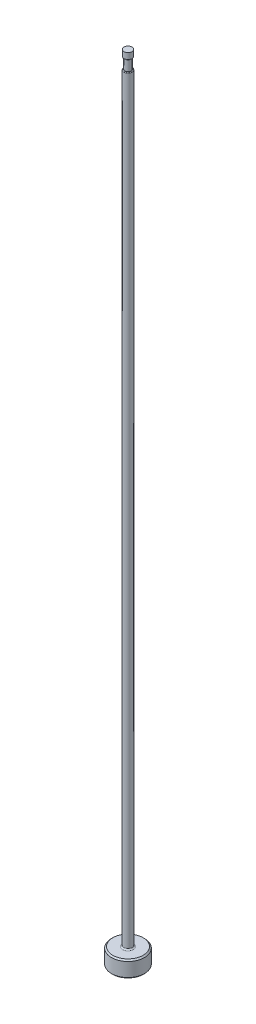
from build123d import *

# Parameters (mm, degrees)
CHAMFER1_SIZE     = 0.254
FILLET1_R         = 0.254
SKETCH2_W         = 0.2032
SKETCH2_H         = 2.032
D_SLOT_DEPTH      = 153.466131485
D_SLOT_DEPTH_BACK = 153.466131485
SKETCH5_W         = 0.01905
SKETCH5_H         = 1.27
FILLET2_R         = 0.127


with BuildPart() as part:
    # Sketch1 → Revolve1 (revolve)
    with BuildSketch(Plane.XY, mode=Mode.PRIVATE) as revolve1_sk:
        Polygon((0, 0), (-3.175, 0), (-3.175, 3.175), (-0.79375, 3.175), (-0.79375, 152.4), (0, 152.4), align=None)
    revolve(revolve1_sk.sketch.rotate(Axis((0, 259.958771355, 0), (0, -1, 0)), 270), axis=Axis((0, 259.958771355, 0), (0, -1, 0)))

    # Chamfer1
    chamfer1_edges = [part.edges().sort_by_distance(p)[0] for p in [
        (0, 3.175, -3.175),
        (0, 0, -3.175),
    ]]
    chamfer(chamfer1_edges, length=CHAMFER1_SIZE)

    # Fillet1
    fillet1_edges = [part.edges().sort_by_distance(p)[0] for p in [
        (0, 3.175, -0.79375),
    ]]
    fillet(fillet1_edges, radius=FILLET1_R)

    # Sketch2 → Vent Relief (revolve, cut)
    with BuildSketch(Plane.XY, mode=Mode.PRIVATE) as vent_relief_sk:
        with Locations((-0.69215, 150.114)):
            Rectangle(SKETCH2_W, SKETCH2_H)
    revolve(vent_relief_sk.sketch.rotate(Axis((0, 153.448281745, 0), (0, -1, 0)), 270), axis=Axis((0, 153.448281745, 0), (0, -1, 0)), mode=Mode.SUBTRACT)

    # Sketch3 → D-Slot (cut, two sides: drawn at the far end of the back side and taken through both)
    with BuildSketch(Plane.XY.offset(-D_SLOT_DEPTH_BACK)):
        with BuildLine():
            Line((-0.59055, 150.114), (-0.59055, 86.614))
            ThreePointArc((-0.59055, 86.614), (-0.641763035, 86.046038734), (-0.79375, 85.4964))
            Line((-0.79375, 85.4964), (-0.79375, 150.114))
            Line((-0.79375, 150.114), (-0.59055, 150.114))
        make_face()
    extrude(amount=D_SLOT_DEPTH + D_SLOT_DEPTH_BACK, mode=Mode.SUBTRACT)

    # Sketch5 → Vent Diameter (revolve, cut)
    with BuildSketch(Plane.XY, mode=Mode.PRIVATE) as vent_diameter_sk:
        with Locations((-0.784225, 151.765)):
            Rectangle(SKETCH5_W, SKETCH5_H)
    revolve(vent_diameter_sk.sketch.rotate(Axis((0, 152.687735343, 0), (0, -1, 0)), 90), axis=Axis((0, 152.687735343, 0), (0, -1, 0)), mode=Mode.SUBTRACT)

    # Fillet2
    fillet2_edges = [part.edges().sort_by_distance(p)[0] for p in [
        (0.724920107, 149.098, -0.323310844),
        (0, 151.13, 0.7747),
    ]]
    fillet(fillet2_edges, radius=FILLET2_R)


solid = part.part
